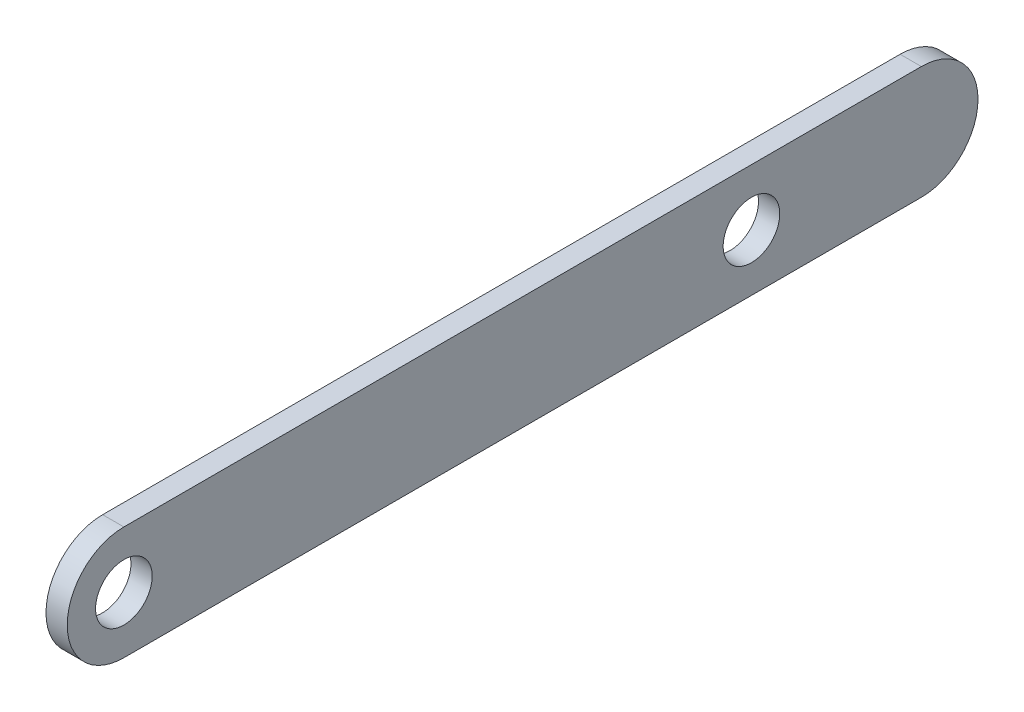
from build123d import *

# Parameters (mm, degrees)
SKETCH1_R           = 6.35
BOSS_EXTRUDE1_DEPTH = 4.7625


with BuildPart() as part:
    # Sketch1 → Boss-Extrude1 (new body)
    with BuildSketch(Plane(origin=(0, 0, 0), x_dir=(0, 0, -1), z_dir=(1, 0, 0))):
        with BuildLine():
            Line((-70.358, 12.7), (70.358, 12.7))
            Line((70.358, 12.7), (108.458, 12.7))
            ThreePointArc((108.458, 12.7), (121.158, 0), (108.458, -12.7))
            Line((108.458, -12.7), (70.358, -12.7))
            Line((70.358, -12.7), (-70.358, -12.7))
            ThreePointArc((-70.358, -12.7), (-83.058, 0), (-70.358, 12.7))
        make_face()
        with Locations(Location((70.358, 0, 0), (0, 0, 180))):
            Circle(SKETCH1_R, mode=Mode.SUBTRACT)
        with Locations(Location((-70.358, 0, 0), (0, 0, 180))):
            Circle(SKETCH1_R, mode=Mode.SUBTRACT)
    extrude(amount=BOSS_EXTRUDE1_DEPTH)


solid = part.part
